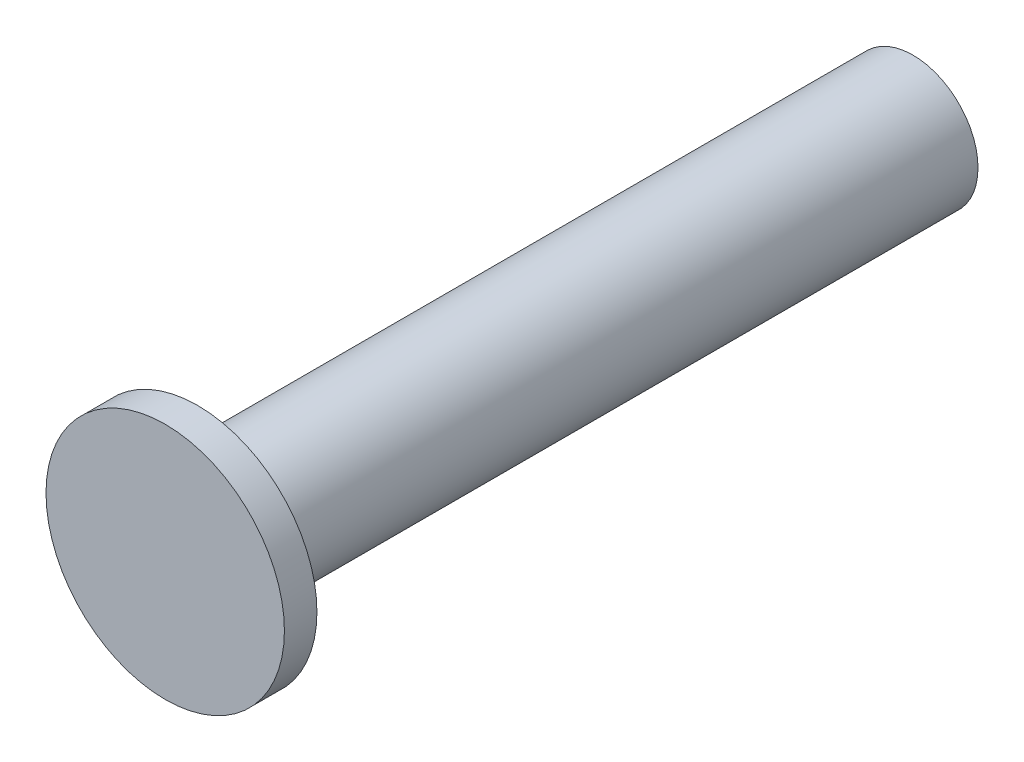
from build123d import *

# Parameters (mm, degrees)
ESQUISSE1_R        = 3
BOSS_EXTRU_1_DEPTH = 33
ESQUISSE2_R        = 5.5
BOSS_EXTRU_2_DEPTH = 1.5


with BuildPart() as part:
    # Esquisse1 → Boss.-Extru.1 (new body)
    with BuildSketch(Plane.XY):
        Circle(ESQUISSE1_R)
    extrude(amount=BOSS_EXTRU_1_DEPTH)

    # Esquisse2 → Boss.-Extru.2 (add)
    with BuildSketch(Plane.XY.offset(33)):
        Circle(ESQUISSE2_R)
    extrude(amount=BOSS_EXTRU_2_DEPTH)


solid = part.part
